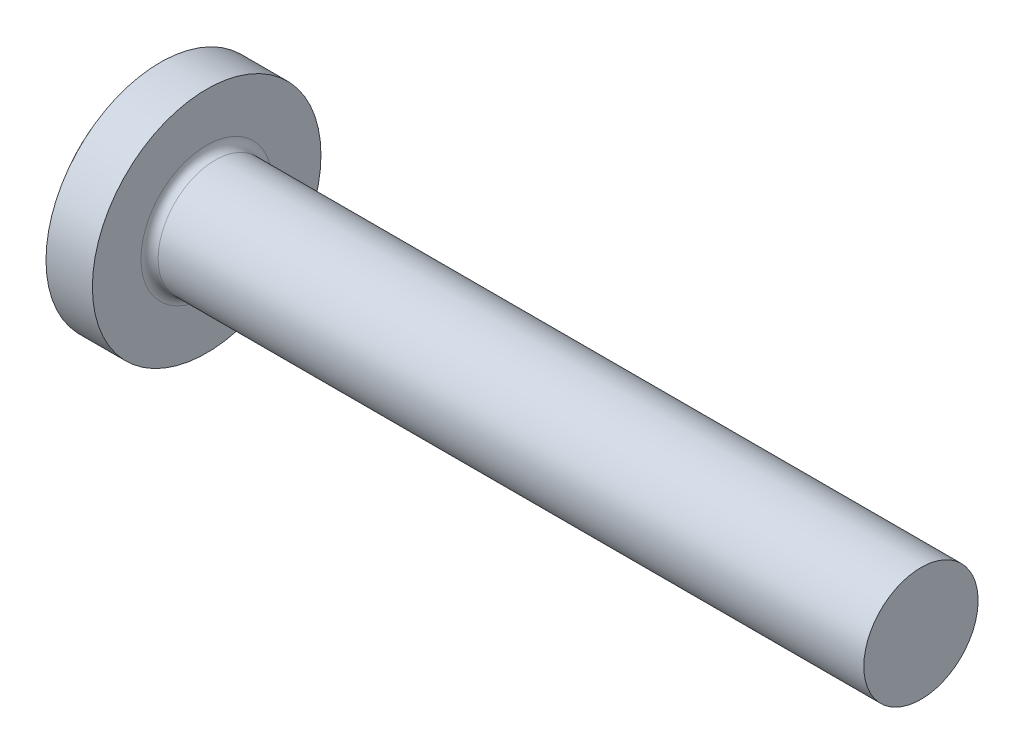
ISO-10303-21;
HEADER;
FILE_DESCRIPTION(('STEP AP214'),'2;1');
FILE_NAME('part.step','',(''),(''),'','','');
FILE_SCHEMA(('AUTOMOTIVE_DESIGN { 1 0 10303 214 1 1 1 1 }'));
ENDSEC;
DATA;
#1=APPLICATION_CONTEXT('core data for automotive mechanical design processes');
#2=APPLICATION_PROTOCOL_DEFINITION('international standard','automotive_design',2000,#1);
#3=PRODUCT_CONTEXT('',#1,'mechanical');
#4=PRODUCT('Part','Part','',(#3));
#5=PRODUCT_RELATED_PRODUCT_CATEGORY('part','',(#4));
#6=PRODUCT_DEFINITION_FORMATION('','',#4);
#7=PRODUCT_DEFINITION_CONTEXT('part definition',#1,'design');
#8=PRODUCT_DEFINITION('design','',#6,#7);
#9=PRODUCT_DEFINITION_SHAPE('','',#8);
#10=(LENGTH_UNIT() NAMED_UNIT(*) SI_UNIT(.MILLI.,.METRE.));
#11=(NAMED_UNIT(*) PLANE_ANGLE_UNIT() SI_UNIT($,.RADIAN.));
#12=(NAMED_UNIT(*) SI_UNIT($,.STERADIAN.) SOLID_ANGLE_UNIT());
#13=UNCERTAINTY_MEASURE_WITH_UNIT(LENGTH_MEASURE(1.E-05),#10,'distance_accuracy_value','');
#14=(GEOMETRIC_REPRESENTATION_CONTEXT(3) GLOBAL_UNCERTAINTY_ASSIGNED_CONTEXT((#13)) GLOBAL_UNIT_ASSIGNED_CONTEXT((#10,
#11,#12)) REPRESENTATION_CONTEXT('',''));
#15=CARTESIAN_POINT('',(0.,0.,0.));
#16=DIRECTION('',(0.,0.,1.));
#17=DIRECTION('',(1.,0.,0.));
#18=AXIS2_PLACEMENT_3D('',#15,#16,#17);
#19=CARTESIAN_POINT('',(13.,0.,0.));
#20=DIRECTION('',(-1.,0.,0.));
#21=DIRECTION('',(0.,1.,0.));
#22=AXIS2_PLACEMENT_3D('',#19,#20,#21);
#23=SPHERICAL_SURFACE('',#22,13.);
#24=CARTESIAN_POINT('',(2.7530492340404,0.,0.));
#25=DIRECTION('',(-1.,0.,0.));
#26=DIRECTION('',(0.,0.,1.));
#27=AXIS2_PLACEMENT_3D('',#24,#25,#26);
#28=CIRCLE('',#27,8.);
#29=CARTESIAN_POINT('',(2.7530492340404,0.,8.));
#30=VERTEX_POINT('',#29);
#31=EDGE_CURVE('E811',#30,#30,#28,.T.);
#32=ORIENTED_EDGE('',*,*,#31,.T.);
#33=EDGE_LOOP('',(#32));
#34=FACE_BOUND('',#33,.T.);
#35=CARTESIAN_POINT('',(0.173606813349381,0.,0.));
#36=DIRECTION('',(1.,0.,0.));
#37=DIRECTION('',(0.,0.,-1.));
#38=AXIS2_PLACEMENT_3D('',#35,#36,#37);
#39=CIRCLE('',#38,2.11746022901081);
#40=CARTESIAN_POINT('',(0.173606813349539,-0.967999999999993,-1.88324555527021));
#41=VERTEX_POINT('',#40);
#42=CARTESIAN_POINT('',(0.173606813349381,-1.88324555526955,-0.968));
#43=VERTEX_POINT('',#42);
#44=EDGE_CURVE('E612',#41,#43,#39,.F.);
#45=ORIENTED_EDGE('',*,*,#44,.F.);
#46=CARTESIAN_POINT('',(13.,-0.968000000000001,0.));
#47=DIRECTION('',(0.,1.,0.));
#48=DIRECTION('',(0.,0.,1.));
#49=AXIS2_PLACEMENT_3D('',#46,#47,#48);
#50=CIRCLE('',#49,12.9639105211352);
#51=CARTESIAN_POINT('',(0.687351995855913,-0.967999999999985,-4.05729899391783));
#52=VERTEX_POINT('',#51);
#53=EDGE_CURVE('E521',#52,#41,#50,.T.);
#54=ORIENTED_EDGE('',*,*,#53,.F.);
#55=CARTESIAN_POINT('',(12.1687962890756,0.,1.66713700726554));
#56=DIRECTION('',(-0.446197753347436,0.,0.894934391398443));
#57=DIRECTION('',(0.894934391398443,0.,0.446197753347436));
#58=AXIS2_PLACEMENT_3D('',#55,#56,#57);
#59=CIRCLE('',#58,12.8658367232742);
#60=CARTESIAN_POINT('',(0.687351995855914,0.968000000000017,-4.05729899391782));
#61=VERTEX_POINT('',#60);
#62=EDGE_CURVE('E60',#61,#52,#59,.T.);
#63=ORIENTED_EDGE('',*,*,#62,.F.);
#64=CARTESIAN_POINT('',(13.,0.968,0.));
#65=DIRECTION('',(0.,-1.,0.));
#66=DIRECTION('',(0.,0.,-1.));
#67=AXIS2_PLACEMENT_3D('',#64,#65,#66);
#68=CIRCLE('',#67,12.9639105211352);
#69=CARTESIAN_POINT('',(0.173606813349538,0.968000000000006,-1.8832455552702));
#70=VERTEX_POINT('',#69);
#71=EDGE_CURVE('E513',#70,#61,#68,.T.);
#72=ORIENTED_EDGE('',*,*,#71,.F.);
#73=CARTESIAN_POINT('',(0.173606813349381,1.88324555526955,-0.968));
#74=VERTEX_POINT('',#73);
#75=EDGE_CURVE('E354',#74,#70,#39,.F.);
#76=ORIENTED_EDGE('',*,*,#75,.F.);
#77=CARTESIAN_POINT('',(13.,0.,-0.968));
#78=DIRECTION('',(0.,0.,1.));
#79=DIRECTION('',(1.,0.,0.));
#80=AXIS2_PLACEMENT_3D('',#77,#78,#79);
#81=CIRCLE('',#80,12.9639105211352);
#82=CARTESIAN_POINT('',(0.687351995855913,4.05729899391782,-0.968));
#83=VERTEX_POINT('',#82);
#84=EDGE_CURVE('E627',#83,#74,#81,.T.);
#85=ORIENTED_EDGE('',*,*,#84,.F.);
#86=CARTESIAN_POINT('',(12.1687962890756,-1.66713700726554,0.));
#87=DIRECTION('',(-0.446197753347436,-0.894934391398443,0.));
#88=DIRECTION('',(0.894934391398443,-0.446197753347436,0.));
#89=AXIS2_PLACEMENT_3D('',#86,#87,#88);
#90=CIRCLE('',#89,12.8658367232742);
#91=CARTESIAN_POINT('',(0.687351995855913,4.05729899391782,0.968000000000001));
#92=VERTEX_POINT('',#91);
#93=EDGE_CURVE('E628',#92,#83,#90,.T.);
#94=ORIENTED_EDGE('',*,*,#93,.F.);
#95=CARTESIAN_POINT('',(13.,0.,0.968000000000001));
#96=DIRECTION('',(0.,0.,-1.));
#97=DIRECTION('',(0.,1.,0.));
#98=AXIS2_PLACEMENT_3D('',#95,#96,#97);
#99=CIRCLE('',#98,12.9639105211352);
#100=CARTESIAN_POINT('',(0.173606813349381,1.88324555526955,0.968));
#101=VERTEX_POINT('',#100);
#102=EDGE_CURVE('E76',#101,#92,#99,.T.);
#103=ORIENTED_EDGE('',*,*,#102,.F.);
#104=CARTESIAN_POINT('',(0.173606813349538,0.967999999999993,1.88324555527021));
#105=VERTEX_POINT('',#104);
#106=EDGE_CURVE('E589',#105,#101,#39,.F.);
#107=ORIENTED_EDGE('',*,*,#106,.F.);
#108=CARTESIAN_POINT('',(0.687351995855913,0.967999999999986,4.05729899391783));
#109=VERTEX_POINT('',#108);
#110=EDGE_CURVE('E525',#109,#105,#68,.T.);
#111=ORIENTED_EDGE('',*,*,#110,.F.);
#112=CARTESIAN_POINT('',(12.1687962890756,0.,-1.66713700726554));
#113=DIRECTION('',(-0.446197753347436,0.,-0.894934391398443));
#114=DIRECTION('',(-0.894934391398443,0.,0.446197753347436));
#115=AXIS2_PLACEMENT_3D('',#112,#113,#114);
#116=CIRCLE('',#115,12.8658367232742);
#117=CARTESIAN_POINT('',(0.687351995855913,-0.968000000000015,4.05729899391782));
#118=VERTEX_POINT('',#117);
#119=EDGE_CURVE('E639',#118,#109,#116,.T.);
#120=ORIENTED_EDGE('',*,*,#119,.F.);
#121=CARTESIAN_POINT('',(0.173606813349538,-0.968000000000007,1.8832455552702));
#122=VERTEX_POINT('',#121);
#123=EDGE_CURVE('E524',#122,#118,#50,.T.);
#124=ORIENTED_EDGE('',*,*,#123,.F.);
#125=CARTESIAN_POINT('',(0.173606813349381,-1.88324555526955,0.968));
#126=VERTEX_POINT('',#125);
#127=EDGE_CURVE('E609',#126,#122,#39,.F.);
#128=ORIENTED_EDGE('',*,*,#127,.F.);
#129=CARTESIAN_POINT('',(0.687351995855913,-4.05729899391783,0.968));
#130=VERTEX_POINT('',#129);
#131=EDGE_CURVE('E635',#130,#126,#99,.T.);
#132=ORIENTED_EDGE('',*,*,#131,.F.);
#133=CARTESIAN_POINT('',(12.1687962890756,1.66713700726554,0.));
#134=DIRECTION('',(-0.446197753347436,0.894934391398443,0.));
#135=DIRECTION('',(-0.894934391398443,-0.446197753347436,0.));
#136=AXIS2_PLACEMENT_3D('',#133,#134,#135);
#137=CIRCLE('',#136,12.8658367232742);
#138=CARTESIAN_POINT('',(0.687351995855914,-4.05729899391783,-0.968000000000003));
#139=VERTEX_POINT('',#138);
#140=EDGE_CURVE('E626',#139,#130,#137,.T.);
#141=ORIENTED_EDGE('',*,*,#140,.F.);
#142=EDGE_CURVE('E624',#43,#139,#81,.T.);
#143=ORIENTED_EDGE('',*,*,#142,.F.);
#144=EDGE_LOOP('',(#45,#54,#63,#72,#76,#85,#94,#103,#107,#111,#120,#124,#128,#132,#141,#143));
#145=FACE_BOUND('',#144,.T.);
#146=ADVANCED_FACE('F50',(#34,#145),#23,.T.);
#147=CARTESIAN_POINT('',(4.5,-2.15638313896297,0.968));
#148=DIRECTION('',(0.,0.,-1.));
#149=DIRECTION('',(0.,1.,0.));
#150=AXIS2_PLACEMENT_3D('',#147,#148,#149);
#151=PLANE('',#150);
#152=ORIENTED_EDGE('',*,*,#131,.T.);
#153=CARTESIAN_POINT('',(0.0720547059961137,-1.89122640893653,0.968));
#154=CARTESIAN_POINT('',(0.732028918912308,-1.83935888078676,0.968));
#155=CARTESIAN_POINT('',(1.39197285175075,-1.78709528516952,0.968));
#156=CARTESIAN_POINT('',(2.71176705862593,-1.68141781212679,0.968));
#157=CARTESIAN_POINT('',(3.37161733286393,-1.6280039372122,0.968));
#158=CARTESIAN_POINT('',(4.18767399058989,-1.56100620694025,0.968));
#159=CARTESIAN_POINT('',(4.34393883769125,-1.54813436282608,0.968));
#160=CARTESIAN_POINT('',(4.5002,-1.53521782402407,0.968));
#161=B_SPLINE_CURVE_WITH_KNOTS('',3,(#153,#154,#155,#156,#157,#158,#159,#160),.UNSPECIFIED.,.F.,
.F.,(4,2,2,4),(0.,1.98602890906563,3.97205348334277,4.44243574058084),.UNSPECIFIED.);
#162=CARTESIAN_POINT('',(4.5,-1.5352343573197,0.968));
#163=VERTEX_POINT('',#162);
#164=EDGE_CURVE('E613',#126,#163,#161,.T.);
#165=ORIENTED_EDGE('',*,*,#164,.T.);
#166=DIRECTION('',(0.,-1.,0.));
#167=VECTOR('',#166,1.);
#168=CARTESIAN_POINT('',(4.5,2.15638313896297,0.968000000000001));
#169=LINE('',#168,#167);
#170=CARTESIAN_POINT('',(4.5,-2.15638313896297,0.968));
#171=VERTEX_POINT('',#170);
#172=EDGE_CURVE('E402',#163,#171,#169,.T.);
#173=ORIENTED_EDGE('',*,*,#172,.T.);
#174=DIRECTION('',(0.894934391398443,0.446197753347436,0.));
#175=VECTOR('',#174,1.);
#176=CARTESIAN_POINT('',(0.,-4.4,0.967999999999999));
#177=LINE('',#176,#175);
#178=EDGE_CURVE('E537',#130,#171,#177,.T.);
#179=ORIENTED_EDGE('',*,*,#178,.F.);
#180=EDGE_LOOP('',(#152,#165,#173,#179));
#181=FACE_BOUND('',#180,.T.);
#182=ADVANCED_FACE('F180',(#181),#151,.T.);
#183=CARTESIAN_POINT('',(4.5,2.15638313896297,0.968000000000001));
#184=VERTEX_POINT('',#183);
#185=CARTESIAN_POINT('',(4.5,1.53523435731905,0.968000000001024));
#186=VERTEX_POINT('',#185);
#187=EDGE_CURVE('E556',#184,#186,#169,.T.);
#188=ORIENTED_EDGE('',*,*,#187,.T.);
#189=CARTESIAN_POINT('',(4.5002,1.53521782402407,0.968000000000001));
#190=CARTESIAN_POINT('',(3.93659640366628,1.58179235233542,0.968000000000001));
#191=CARTESIAN_POINT('',(3.37294640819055,1.62780041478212,0.968));
#192=CARTESIAN_POINT('',(2.24557180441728,1.71888378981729,0.968));
#193=CARTESIAN_POINT('',(1.68184719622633,1.76395910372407,0.968));
#194=CARTESIAN_POINT('',(0.769424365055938,1.8363197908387,0.968));
#195=CARTESIAN_POINT('',(0.420744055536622,1.86383129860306,0.968));
#196=CARTESIAN_POINT('',(0.0720547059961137,1.89122640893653,0.968));
#197=B_SPLINE_CURVE_WITH_KNOTS('',3,(#189,#190,#191,#192,#193,#194,#195,#196),.UNSPECIFIED.,.F.,
.F.,(4,2,2,4),(0.,1.69657324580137,3.3931440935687,4.44243584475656),.UNSPECIFIED.);
#198=EDGE_CURVE('E608',#186,#101,#197,.T.);
#199=ORIENTED_EDGE('',*,*,#198,.T.);
#200=ORIENTED_EDGE('',*,*,#102,.T.);
#201=DIRECTION('',(0.894934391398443,-0.446197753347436,0.));
#202=VECTOR('',#201,1.);
#203=CARTESIAN_POINT('',(0.,4.4,0.968000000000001));
#204=LINE('',#203,#202);
#205=EDGE_CURVE('E534',#92,#184,#204,.T.);
#206=ORIENTED_EDGE('',*,*,#205,.T.);
#207=EDGE_LOOP('',(#188,#199,#200,#206));
#208=FACE_BOUND('',#207,.T.);
#209=ADVANCED_FACE('F185',(#208),#151,.T.);
#210=CARTESIAN_POINT('',(4.5,2.15638313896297,-0.968));
#211=DIRECTION('',(0.,0.,1.));
#212=DIRECTION('',(1.,0.,0.));
#213=AXIS2_PLACEMENT_3D('',#210,#211,#212);
#214=PLANE('',#213);
#215=DIRECTION('',(0.,1.,0.));
#216=VECTOR('',#215,1.);
#217=CARTESIAN_POINT('',(4.5,2.15638313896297,-0.968));
#218=LINE('',#217,#216);
#219=CARTESIAN_POINT('',(4.5,-2.15638313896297,-0.968));
#220=VERTEX_POINT('',#219);
#221=CARTESIAN_POINT('',(4.5,-1.53523435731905,-0.968000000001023));
#222=VERTEX_POINT('',#221);
#223=EDGE_CURVE('E554',#220,#222,#218,.T.);
#224=ORIENTED_EDGE('',*,*,#223,.T.);
#225=CARTESIAN_POINT('',(4.5002,-1.53521782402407,-0.968));
#226=CARTESIAN_POINT('',(3.93659640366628,-1.58179235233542,-0.968));
#227=CARTESIAN_POINT('',(3.37294640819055,-1.62780041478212,-0.968));
#228=CARTESIAN_POINT('',(2.24557180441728,-1.71888378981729,-0.968));
#229=CARTESIAN_POINT('',(1.68184719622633,-1.76395910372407,-0.968));
#230=CARTESIAN_POINT('',(0.769424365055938,-1.8363197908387,-0.968));
#231=CARTESIAN_POINT('',(0.420744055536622,-1.86383129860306,-0.968));
#232=CARTESIAN_POINT('',(0.0720547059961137,-1.89122640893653,-0.968));
#233=B_SPLINE_CURVE_WITH_KNOTS('',3,(#225,#226,#227,#228,#229,#230,#231,#232),.UNSPECIFIED.,.F.,
.F.,(4,2,2,4),(0.,1.69657324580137,3.3931440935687,4.44243584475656),.UNSPECIFIED.);
#234=EDGE_CURVE('E617',#222,#43,#233,.T.);
#235=ORIENTED_EDGE('',*,*,#234,.T.);
#236=ORIENTED_EDGE('',*,*,#142,.T.);
#237=DIRECTION('',(0.894934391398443,0.446197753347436,0.));
#238=VECTOR('',#237,1.);
#239=CARTESIAN_POINT('',(0.,-4.4,-0.968000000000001));
#240=LINE('',#239,#238);
#241=EDGE_CURVE('E533',#139,#220,#240,.T.);
#242=ORIENTED_EDGE('',*,*,#241,.T.);
#243=EDGE_LOOP('',(#224,#235,#236,#242));
#244=FACE_BOUND('',#243,.T.);
#245=ADVANCED_FACE('F362',(#244),#214,.T.);
#246=ORIENTED_EDGE('',*,*,#84,.T.);
#247=CARTESIAN_POINT('',(0.0720547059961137,1.89122640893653,-0.968));
#248=CARTESIAN_POINT('',(0.732028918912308,1.83935888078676,-0.968));
#249=CARTESIAN_POINT('',(1.39197285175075,1.78709528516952,-0.968));
#250=CARTESIAN_POINT('',(2.71176705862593,1.68141781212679,-0.968));
#251=CARTESIAN_POINT('',(3.37161733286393,1.6280039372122,-0.968));
#252=CARTESIAN_POINT('',(4.18767399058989,1.56100620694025,-0.968));
#253=CARTESIAN_POINT('',(4.34393883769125,1.54813436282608,-0.968));
#254=CARTESIAN_POINT('',(4.5002,1.53521782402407,-0.968));
#255=B_SPLINE_CURVE_WITH_KNOTS('',3,(#247,#248,#249,#250,#251,#252,#253,#254),.UNSPECIFIED.,.F.,
.F.,(4,2,2,4),(0.,1.98602890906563,3.97205348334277,4.44243574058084),.UNSPECIFIED.);
#256=CARTESIAN_POINT('',(4.5,1.5352343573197,-0.968));
#257=VERTEX_POINT('',#256);
#258=EDGE_CURVE('E351',#74,#257,#255,.T.);
#259=ORIENTED_EDGE('',*,*,#258,.T.);
#260=CARTESIAN_POINT('',(4.5,2.15638313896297,-0.968));
#261=VERTEX_POINT('',#260);
#262=EDGE_CURVE('E390',#257,#261,#218,.T.);
#263=ORIENTED_EDGE('',*,*,#262,.T.);
#264=DIRECTION('',(0.894934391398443,-0.446197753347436,0.));
#265=VECTOR('',#264,1.);
#266=CARTESIAN_POINT('',(0.,4.4,-0.968));
#267=LINE('',#266,#265);
#268=EDGE_CURVE('E531',#83,#261,#267,.T.);
#269=ORIENTED_EDGE('',*,*,#268,.F.);
#270=EDGE_LOOP('',(#246,#259,#263,#269));
#271=FACE_BOUND('',#270,.T.);
#272=ADVANCED_FACE('F213',(#271),#214,.T.);
#273=CARTESIAN_POINT('',(4.5,-2.15638313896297,0.968));
#274=DIRECTION('',(1.,0.,0.));
#275=DIRECTION('',(0.,0.,-1.));
#276=AXIS2_PLACEMENT_3D('',#273,#274,#275);
#277=PLANE('',#276);
#278=CARTESIAN_POINT('',(4.5,0.,0.));
#279=DIRECTION('',(-1.,0.,0.));
#280=DIRECTION('',(0.,0.,1.));
#281=AXIS2_PLACEMENT_3D('',#278,#279,#280);
#282=CIRCLE('',#281,1.81492934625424);
#283=EDGE_CURVE('E565',#222,#163,#282,.T.);
#284=ORIENTED_EDGE('',*,*,#283,.F.);
#285=ORIENTED_EDGE('',*,*,#223,.F.);
#286=DIRECTION('',(0.,0.,-1.));
#287=VECTOR('',#286,1.);
#288=CARTESIAN_POINT('',(4.5,-2.15638313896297,0.968));
#289=LINE('',#288,#287);
#290=EDGE_CURVE('E421',#171,#220,#289,.T.);
#291=ORIENTED_EDGE('',*,*,#290,.F.);
#292=ORIENTED_EDGE('',*,*,#172,.F.);
#293=EDGE_LOOP('',(#284,#285,#291,#292));
#294=FACE_BOUND('',#293,.T.);
#295=ADVANCED_FACE('F208',(#294),#277,.F.);
#296=CARTESIAN_POINT('',(4.5,-0.968000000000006,1.5352343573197));
#297=VERTEX_POINT('',#296);
#298=CARTESIAN_POINT('',(4.5,0.967999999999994,1.5352343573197));
#299=VERTEX_POINT('',#298);
#300=EDGE_CURVE('E581',#297,#299,#282,.T.);
#301=ORIENTED_EDGE('',*,*,#300,.F.);
#302=DIRECTION('',(0.,0.,-1.));
#303=VECTOR('',#302,1.);
#304=CARTESIAN_POINT('',(4.5,-0.968000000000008,2.15638313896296));
#305=LINE('',#304,#303);
#306=CARTESIAN_POINT('',(4.5,-0.968000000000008,2.15638313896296));
#307=VERTEX_POINT('',#306);
#308=EDGE_CURVE('E54',#307,#297,#305,.T.);
#309=ORIENTED_EDGE('',*,*,#308,.F.);
#310=DIRECTION('',(0.,-1.,0.));
#311=VECTOR('',#310,1.);
#312=CARTESIAN_POINT('',(4.5,-0.968000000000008,2.15638313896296));
#313=LINE('',#312,#311);
#314=CARTESIAN_POINT('',(4.5,0.967999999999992,2.15638313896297));
#315=VERTEX_POINT('',#314);
#316=EDGE_CURVE('E494',#315,#307,#313,.T.);
#317=ORIENTED_EDGE('',*,*,#316,.F.);
#318=DIRECTION('',(0.,0.,1.));
#319=VECTOR('',#318,1.);
#320=CARTESIAN_POINT('',(4.5,0.967999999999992,2.15638313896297));
#321=LINE('',#320,#319);
#322=EDGE_CURVE('E287',#299,#315,#321,.T.);
#323=ORIENTED_EDGE('',*,*,#322,.F.);
#324=EDGE_LOOP('',(#301,#309,#317,#323));
#325=FACE_BOUND('',#324,.T.);
#326=ADVANCED_FACE('F212',(#325),#277,.F.);
#327=EDGE_CURVE('E559',#186,#257,#282,.T.);
#328=ORIENTED_EDGE('',*,*,#327,.F.);
#329=ORIENTED_EDGE('',*,*,#187,.F.);
#330=DIRECTION('',(0.,0.,1.));
#331=VECTOR('',#330,1.);
#332=CARTESIAN_POINT('',(4.5,2.15638313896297,0.968000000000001));
#333=LINE('',#332,#331);
#334=EDGE_CURVE('E544',#261,#184,#333,.T.);
#335=ORIENTED_EDGE('',*,*,#334,.F.);
#336=ORIENTED_EDGE('',*,*,#262,.F.);
#337=EDGE_LOOP('',(#328,#329,#335,#336));
#338=FACE_BOUND('',#337,.T.);
#339=ADVANCED_FACE('F557',(#338),#277,.F.);
#340=CARTESIAN_POINT('',(4.5,0.968000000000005,-1.5352343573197));
#341=VERTEX_POINT('',#340);
#342=CARTESIAN_POINT('',(4.5,-0.967999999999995,-1.5352343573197));
#343=VERTEX_POINT('',#342);
#344=EDGE_CURVE('E490',#341,#343,#282,.T.);
#345=ORIENTED_EDGE('',*,*,#344,.F.);
#346=CARTESIAN_POINT('',(4.5,0.968000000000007,-2.15638313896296));
#347=VERTEX_POINT('',#346);
#348=EDGE_CURVE('E487',#347,#341,#321,.T.);
#349=ORIENTED_EDGE('',*,*,#348,.F.);
#350=DIRECTION('',(0.,1.,0.));
#351=VECTOR('',#350,1.);
#352=CARTESIAN_POINT('',(4.5,-0.967999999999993,-2.15638313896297));
#353=LINE('',#352,#351);
#354=CARTESIAN_POINT('',(4.5,-0.967999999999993,-2.15638313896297));
#355=VERTEX_POINT('',#354);
#356=EDGE_CURVE('E488',#355,#347,#353,.T.);
#357=ORIENTED_EDGE('',*,*,#356,.F.);
#358=EDGE_CURVE('E353',#343,#355,#305,.T.);
#359=ORIENTED_EDGE('',*,*,#358,.F.);
#360=EDGE_LOOP('',(#345,#349,#357,#359));
#361=FACE_BOUND('',#360,.T.);
#362=ADVANCED_FACE('F215',(#361),#277,.F.);
#363=CARTESIAN_POINT('',(4.5,0.967999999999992,2.15638313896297));
#364=DIRECTION('',(0.,-1.,0.));
#365=DIRECTION('',(1.,0.,0.));
#366=AXIS2_PLACEMENT_3D('',#363,#364,#365);
#367=PLANE('',#366);
#368=ORIENTED_EDGE('',*,*,#348,.T.);
#369=CARTESIAN_POINT('',(4.5002,0.968000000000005,-1.53521782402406));
#370=CARTESIAN_POINT('',(3.93659640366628,0.968000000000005,-1.58179235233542));
#371=CARTESIAN_POINT('',(3.37294640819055,0.968000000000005,-1.62780041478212));
#372=CARTESIAN_POINT('',(2.24557180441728,0.968000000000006,-1.71888378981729));
#373=CARTESIAN_POINT('',(1.68184719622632,0.968000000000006,-1.76395910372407));
#374=CARTESIAN_POINT('',(0.769424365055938,0.968000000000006,-1.8363197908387));
#375=CARTESIAN_POINT('',(0.420744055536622,0.968000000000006,-1.86383129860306));
#376=CARTESIAN_POINT('',(0.0720547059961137,0.968000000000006,-1.89122640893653));
#377=B_SPLINE_CURVE_WITH_KNOTS('',3,(#369,#370,#371,#372,#373,#374,#375,#376),.UNSPECIFIED.,.F.,
.F.,(4,2,2,4),(0.,1.69657324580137,3.3931440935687,4.44243584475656),.UNSPECIFIED.);
#378=EDGE_CURVE('E350',#341,#70,#377,.T.);
#379=ORIENTED_EDGE('',*,*,#378,.T.);
#380=ORIENTED_EDGE('',*,*,#71,.T.);
#381=DIRECTION('',(0.894934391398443,0.,0.446197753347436));
#382=VECTOR('',#381,1.);
#383=CARTESIAN_POINT('',(0.,0.968000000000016,-4.4));
#384=LINE('',#383,#382);
#385=EDGE_CURVE('E499',#61,#347,#384,.T.);
#386=ORIENTED_EDGE('',*,*,#385,.T.);
#387=EDGE_LOOP('',(#368,#379,#380,#386));
#388=FACE_BOUND('',#387,.T.);
#389=ADVANCED_FACE('F297',(#388),#367,.T.);
#390=CARTESIAN_POINT('',(4.5,-0.967999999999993,-2.15638313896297));
#391=DIRECTION('',(0.,1.,0.));
#392=DIRECTION('',(0.,0.,1.));
#393=AXIS2_PLACEMENT_3D('',#390,#391,#392);
#394=PLANE('',#393);
#395=ORIENTED_EDGE('',*,*,#53,.T.);
#396=CARTESIAN_POINT('',(0.0720547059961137,-0.967999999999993,-1.89122640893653));
#397=CARTESIAN_POINT('',(0.732028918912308,-0.967999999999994,-1.83935888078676));
#398=CARTESIAN_POINT('',(1.39197285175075,-0.967999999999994,-1.78709528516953));
#399=CARTESIAN_POINT('',(2.71176705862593,-0.967999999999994,-1.6814178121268));
#400=CARTESIAN_POINT('',(3.37161733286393,-0.967999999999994,-1.6280039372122));
#401=CARTESIAN_POINT('',(4.18767399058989,-0.967999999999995,-1.56100620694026));
#402=CARTESIAN_POINT('',(4.34393883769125,-0.967999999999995,-1.54813436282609));
#403=CARTESIAN_POINT('',(4.5002,-0.967999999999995,-1.53521782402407));
#404=B_SPLINE_CURVE_WITH_KNOTS('',3,(#396,#397,#398,#399,#400,#401,#402,#403),.UNSPECIFIED.,.F.,
.F.,(4,2,2,4),(0.,1.98602890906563,3.97205348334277,4.44243574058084),.UNSPECIFIED.);
#405=EDGE_CURVE('E616',#41,#343,#404,.T.);
#406=ORIENTED_EDGE('',*,*,#405,.T.);
#407=ORIENTED_EDGE('',*,*,#358,.T.);
#408=DIRECTION('',(0.894934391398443,0.,0.446197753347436));
#409=VECTOR('',#408,1.);
#410=CARTESIAN_POINT('',(0.,-0.967999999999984,-4.4));
#411=LINE('',#410,#409);
#412=EDGE_CURVE('E502',#52,#355,#411,.T.);
#413=ORIENTED_EDGE('',*,*,#412,.F.);
#414=EDGE_LOOP('',(#395,#406,#407,#413));
#415=FACE_BOUND('',#414,.T.);
#416=ADVANCED_FACE('F458',(#415),#394,.T.);
#417=ORIENTED_EDGE('',*,*,#308,.T.);
#418=CARTESIAN_POINT('',(4.5002,-0.968000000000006,1.53521782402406));
#419=CARTESIAN_POINT('',(3.93659640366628,-0.968000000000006,1.58179235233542));
#420=CARTESIAN_POINT('',(3.37294640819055,-0.968000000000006,1.62780041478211));
#421=CARTESIAN_POINT('',(2.24557180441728,-0.968000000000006,1.71888378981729));
#422=CARTESIAN_POINT('',(1.68184719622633,-0.968000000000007,1.76395910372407));
#423=CARTESIAN_POINT('',(0.769424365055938,-0.968000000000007,1.8363197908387));
#424=CARTESIAN_POINT('',(0.420744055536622,-0.968000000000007,1.86383129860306));
#425=CARTESIAN_POINT('',(0.0720547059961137,-0.968000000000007,1.89122640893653));
#426=B_SPLINE_CURVE_WITH_KNOTS('',3,(#418,#419,#420,#421,#422,#423,#424,#425),.UNSPECIFIED.,.F.,
.F.,(4,2,2,4),(0.,1.69657324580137,3.3931440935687,4.44243584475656),.UNSPECIFIED.);
#427=EDGE_CURVE('E611',#297,#122,#426,.T.);
#428=ORIENTED_EDGE('',*,*,#427,.T.);
#429=ORIENTED_EDGE('',*,*,#123,.T.);
#430=DIRECTION('',(0.894934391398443,0.,-0.446197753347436));
#431=VECTOR('',#430,1.);
#432=CARTESIAN_POINT('',(0.,-0.968000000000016,4.4));
#433=LINE('',#432,#431);
#434=EDGE_CURVE('E511',#118,#307,#433,.T.);
#435=ORIENTED_EDGE('',*,*,#434,.T.);
#436=EDGE_LOOP('',(#417,#428,#429,#435));
#437=FACE_BOUND('',#436,.T.);
#438=ADVANCED_FACE('F466',(#437),#394,.T.);
#439=ORIENTED_EDGE('',*,*,#110,.T.);
#440=CARTESIAN_POINT('',(0.0720547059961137,0.967999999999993,1.89122640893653));
#441=CARTESIAN_POINT('',(0.732028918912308,0.967999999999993,1.83935888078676));
#442=CARTESIAN_POINT('',(1.39197285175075,0.967999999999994,1.78709528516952));
#443=CARTESIAN_POINT('',(2.71176705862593,0.967999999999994,1.6814178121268));
#444=CARTESIAN_POINT('',(3.37161733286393,0.967999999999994,1.6280039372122));
#445=CARTESIAN_POINT('',(4.18767399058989,0.967999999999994,1.56100620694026));
#446=CARTESIAN_POINT('',(4.34393883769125,0.967999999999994,1.54813436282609));
#447=CARTESIAN_POINT('',(4.5002,0.967999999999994,1.53521782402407));
#448=B_SPLINE_CURVE_WITH_KNOTS('',3,(#440,#441,#442,#443,#444,#445,#446,#447),.UNSPECIFIED.,.F.,
.F.,(4,2,2,4),(0.,1.98602890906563,3.97205348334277,4.44243574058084),.UNSPECIFIED.);
#449=EDGE_CURVE('E12',#105,#299,#448,.T.);
#450=ORIENTED_EDGE('',*,*,#449,.T.);
#451=ORIENTED_EDGE('',*,*,#322,.T.);
#452=DIRECTION('',(0.894934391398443,0.,-0.446197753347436));
#453=VECTOR('',#452,1.);
#454=CARTESIAN_POINT('',(0.,0.967999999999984,4.4));
#455=LINE('',#454,#453);
#456=EDGE_CURVE('E508',#109,#315,#455,.T.);
#457=ORIENTED_EDGE('',*,*,#456,.F.);
#458=EDGE_LOOP('',(#439,#450,#451,#457));
#459=FACE_BOUND('',#458,.T.);
#460=ADVANCED_FACE('F195',(#459),#367,.T.);
#461=CARTESIAN_POINT('',(56.,4.,0.));
#462=DIRECTION('',(-1.,0.,0.));
#463=DIRECTION('',(0.,0.,1.));
#464=AXIS2_PLACEMENT_3D('',#461,#462,#463);
#465=PLANE('',#464);
#466=CARTESIAN_POINT('',(56.,0.,0.));
#467=DIRECTION('',(-1.,0.,0.));
#468=DIRECTION('',(0.,0.,1.));
#469=AXIS2_PLACEMENT_3D('',#466,#467,#468);
#470=CIRCLE('',#469,4.);
#471=CARTESIAN_POINT('',(56.,0.,4.));
#472=VERTEX_POINT('',#471);
#473=EDGE_CURVE('E804',#472,#472,#470,.T.);
#474=ORIENTED_EDGE('',*,*,#473,.F.);
#475=EDGE_LOOP('',(#474));
#476=FACE_BOUND('',#475,.T.);
#477=ADVANCED_FACE('F191',(#476),#465,.F.);
#478=CARTESIAN_POINT('',(0.,0.,0.));
#479=DIRECTION('',(-1.,0.,0.));
#480=DIRECTION('',(0.,0.,1.));
#481=AXIS2_PLACEMENT_3D('',#478,#479,#480);
#482=CYLINDRICAL_SURFACE('',#481,4.);
#483=CARTESIAN_POINT('',(6.6,0.,0.));
#484=DIRECTION('',(-1.,0.,0.));
#485=DIRECTION('',(0.,0.,1.));
#486=AXIS2_PLACEMENT_3D('',#483,#484,#485);
#487=CIRCLE('',#486,4.);
#488=CARTESIAN_POINT('',(6.6,0.,4.));
#489=VERTEX_POINT('',#488);
#490=EDGE_CURVE('E631',#489,#489,#487,.F.);
#491=ORIENTED_EDGE('',*,*,#490,.T.);
#492=EDGE_LOOP('',(#491));
#493=FACE_BOUND('',#492,.T.);
#494=ORIENTED_EDGE('',*,*,#473,.T.);
#495=EDGE_LOOP('',(#494));
#496=FACE_BOUND('',#495,.T.);
#497=ADVANCED_FACE('F194',(#493,#496),#482,.T.);
#498=CARTESIAN_POINT('',(6.,4.,0.));
#499=DIRECTION('',(-1.,0.,0.));
#500=DIRECTION('',(0.,0.,1.));
#501=AXIS2_PLACEMENT_3D('',#498,#499,#500);
#502=PLANE('',#501);
#503=CARTESIAN_POINT('',(6.,0.,0.));
#504=DIRECTION('',(-1.,0.,0.));
#505=DIRECTION('',(0.,0.,1.));
#506=AXIS2_PLACEMENT_3D('',#503,#504,#505);
#507=CIRCLE('',#506,4.6);
#508=CARTESIAN_POINT('',(6.,0.,4.6));
#509=VERTEX_POINT('',#508);
#510=EDGE_CURVE('E803',#509,#509,#507,.T.);
#511=ORIENTED_EDGE('',*,*,#510,.T.);
#512=EDGE_LOOP('',(#511));
#513=FACE_BOUND('',#512,.T.);
#514=CARTESIAN_POINT('',(6.,0.,0.));
#515=DIRECTION('',(-1.,0.,0.));
#516=DIRECTION('',(0.,0.,1.));
#517=AXIS2_PLACEMENT_3D('',#514,#515,#516);
#518=CIRCLE('',#517,8.);
#519=CARTESIAN_POINT('',(6.,0.,8.));
#520=VERTEX_POINT('',#519);
#521=EDGE_CURVE('E807',#520,#520,#518,.T.);
#522=ORIENTED_EDGE('',*,*,#521,.F.);
#523=EDGE_LOOP('',(#522));
#524=FACE_BOUND('',#523,.T.);
#525=ADVANCED_FACE('F199',(#513,#524),#502,.F.);
#526=CARTESIAN_POINT('',(0.,0.,0.));
#527=DIRECTION('',(-1.,0.,0.));
#528=DIRECTION('',(0.,0.,1.));
#529=AXIS2_PLACEMENT_3D('',#526,#527,#528);
#530=CYLINDRICAL_SURFACE('',#529,8.);
#531=ORIENTED_EDGE('',*,*,#31,.F.);
#532=EDGE_LOOP('',(#531));
#533=FACE_BOUND('',#532,.T.);
#534=ORIENTED_EDGE('',*,*,#521,.T.);
#535=EDGE_LOOP('',(#534));
#536=FACE_BOUND('',#535,.T.);
#537=ADVANCED_FACE('F203',(#533,#536),#530,.T.);
#538=CARTESIAN_POINT('',(6.6,0.,0.));
#539=DIRECTION('',(-1.,0.,0.));
#540=DIRECTION('',(0.,0.,1.));
#541=AXIS2_PLACEMENT_3D('',#538,#539,#540);
#542=TOROIDAL_SURFACE('',#541,4.6,0.6);
#543=ORIENTED_EDGE('',*,*,#490,.F.);
#544=EDGE_LOOP('',(#543));
#545=FACE_BOUND('',#544,.T.);
#546=ORIENTED_EDGE('',*,*,#510,.F.);
#547=EDGE_LOOP('',(#546));
#548=FACE_BOUND('',#547,.T.);
#549=ADVANCED_FACE('F52',(#545,#548),#542,.F.);
#550=CARTESIAN_POINT('',(4.5,-2.15638313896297,-0.968));
#551=DIRECTION('',(-0.446197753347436,0.894934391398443,0.));
#552=DIRECTION('',(-0.894934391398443,-0.446197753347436,0.));
#553=AXIS2_PLACEMENT_3D('',#550,#551,#552);
#554=PLANE('',#553);
#555=ORIENTED_EDGE('',*,*,#140,.T.);
#556=ORIENTED_EDGE('',*,*,#178,.T.);
#557=ORIENTED_EDGE('',*,*,#290,.T.);
#558=ORIENTED_EDGE('',*,*,#241,.F.);
#559=EDGE_LOOP('',(#555,#556,#557,#558));
#560=FACE_BOUND('',#559,.T.);
#561=ADVANCED_FACE('F424',(#560),#554,.T.);
#562=CARTESIAN_POINT('',(4.5,2.15638313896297,0.968000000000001));
#563=DIRECTION('',(-0.446197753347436,-0.894934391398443,0.));
#564=DIRECTION('',(0.894934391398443,-0.446197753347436,0.));
#565=AXIS2_PLACEMENT_3D('',#562,#563,#564);
#566=PLANE('',#565);
#567=ORIENTED_EDGE('',*,*,#93,.T.);
#568=ORIENTED_EDGE('',*,*,#268,.T.);
#569=ORIENTED_EDGE('',*,*,#334,.T.);
#570=ORIENTED_EDGE('',*,*,#205,.F.);
#571=EDGE_LOOP('',(#567,#568,#569,#570));
#572=FACE_BOUND('',#571,.T.);
#573=ADVANCED_FACE('F216',(#572),#566,.T.);
#574=CARTESIAN_POINT('',(4.5,0.968000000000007,-2.15638313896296));
#575=DIRECTION('',(-0.446197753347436,0.,0.894934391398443));
#576=DIRECTION('',(-0.894934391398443,0.,-0.446197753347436));
#577=AXIS2_PLACEMENT_3D('',#574,#575,#576);
#578=PLANE('',#577);
#579=ORIENTED_EDGE('',*,*,#62,.T.);
#580=ORIENTED_EDGE('',*,*,#412,.T.);
#581=ORIENTED_EDGE('',*,*,#356,.T.);
#582=ORIENTED_EDGE('',*,*,#385,.F.);
#583=EDGE_LOOP('',(#579,#580,#581,#582));
#584=FACE_BOUND('',#583,.T.);
#585=ADVANCED_FACE('F303',(#584),#578,.T.);
#586=CARTESIAN_POINT('',(4.5,-0.968000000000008,2.15638313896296));
#587=DIRECTION('',(-0.446197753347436,0.,-0.894934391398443));
#588=DIRECTION('',(0.894934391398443,0.,-0.446197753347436));
#589=AXIS2_PLACEMENT_3D('',#586,#587,#588);
#590=PLANE('',#589);
#591=ORIENTED_EDGE('',*,*,#119,.T.);
#592=ORIENTED_EDGE('',*,*,#456,.T.);
#593=ORIENTED_EDGE('',*,*,#316,.T.);
#594=ORIENTED_EDGE('',*,*,#434,.F.);
#595=EDGE_LOOP('',(#591,#592,#593,#594));
#596=FACE_BOUND('',#595,.T.);
#597=ADVANCED_FACE('F432',(#596),#590,.T.);
#598=CARTESIAN_POINT('',(4.5,0.,0.));
#599=DIRECTION('',(-1.,0.,0.));
#600=DIRECTION('',(0.,0.,1.));
#601=AXIS2_PLACEMENT_3D('',#598,#599,#600);
#602=CONICAL_SURFACE('',#601,1.81492934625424,0.0698131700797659);
#603=ORIENTED_EDGE('',*,*,#75,.T.);
#604=ORIENTED_EDGE('',*,*,#378,.F.);
#605=EDGE_CURVE('E599',#257,#341,#282,.T.);
#606=ORIENTED_EDGE('',*,*,#605,.F.);
#607=ORIENTED_EDGE('',*,*,#258,.F.);
#608=EDGE_LOOP('',(#603,#604,#606,#607));
#609=FACE_BOUND('',#608,.T.);
#610=ADVANCED_FACE('F178',(#609),#602,.F.);
#611=EDGE_CURVE('E604',#343,#222,#282,.T.);
#612=ORIENTED_EDGE('',*,*,#611,.F.);
#613=ORIENTED_EDGE('',*,*,#405,.F.);
#614=ORIENTED_EDGE('',*,*,#44,.T.);
#615=ORIENTED_EDGE('',*,*,#234,.F.);
#616=EDGE_LOOP('',(#612,#613,#614,#615));
#617=FACE_BOUND('',#616,.T.);
#618=ADVANCED_FACE('F621',(#617),#602,.F.);
#619=ORIENTED_EDGE('',*,*,#127,.T.);
#620=ORIENTED_EDGE('',*,*,#427,.F.);
#621=EDGE_CURVE('E583',#163,#297,#282,.T.);
#622=ORIENTED_EDGE('',*,*,#621,.F.);
#623=ORIENTED_EDGE('',*,*,#164,.F.);
#624=EDGE_LOOP('',(#619,#620,#622,#623));
#625=FACE_BOUND('',#624,.T.);
#626=ADVANCED_FACE('F176',(#625),#602,.F.);
#627=EDGE_CURVE('E68',#299,#186,#282,.T.);
#628=ORIENTED_EDGE('',*,*,#627,.F.);
#629=ORIENTED_EDGE('',*,*,#449,.F.);
#630=ORIENTED_EDGE('',*,*,#106,.T.);
#631=ORIENTED_EDGE('',*,*,#198,.F.);
#632=EDGE_LOOP('',(#628,#629,#630,#631));
#633=FACE_BOUND('',#632,.T.);
#634=ADVANCED_FACE('F170',(#633),#602,.F.);
#635=CARTESIAN_POINT('',(5.0897062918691,0.,0.));
#636=DIRECTION('',(-1.,0.,0.));
#637=DIRECTION('',(0.,0.,1.));
#638=AXIS2_PLACEMENT_3D('',#635,#636,#637);
#639=CONICAL_SURFACE('',#638,0.,1.25663706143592);
#640=ORIENTED_EDGE('',*,*,#627,.T.);
#641=ORIENTED_EDGE('',*,*,#327,.T.);
#642=ORIENTED_EDGE('',*,*,#605,.T.);
#643=ORIENTED_EDGE('',*,*,#344,.T.);
#644=ORIENTED_EDGE('',*,*,#611,.T.);
#645=ORIENTED_EDGE('',*,*,#283,.T.);
#646=ORIENTED_EDGE('',*,*,#621,.T.);
#647=ORIENTED_EDGE('',*,*,#300,.T.);
#648=EDGE_LOOP('',(#640,#641,#642,#643,#644,#645,#646,#647));
#649=FACE_BOUND('',#648,.T.);
#650=CARTESIAN_POINT('',(5.0897062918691,0.,0.));
#651=VERTEX_POINT('',#650);
#652=VERTEX_LOOP('',#651);
#653=FACE_BOUND('',#652,.T.);
#654=ADVANCED_FACE('F168',(#649,#653),#639,.F.);
#655=CLOSED_SHELL('',(#146,#182,#209,#245,#272,#295,#326,#339,#362,#389,#416,#438,#460,#477,
#497,#525,#537,#549,#561,#573,#585,#597,#610,#618,#626,#634,#654));
#656=MANIFOLD_SOLID_BREP('B2',#655);
#657=ADVANCED_BREP_SHAPE_REPRESENTATION('',(#18,#656),#14);
#658=SHAPE_DEFINITION_REPRESENTATION(#9,#657);
ENDSEC;
END-ISO-10303-21;
